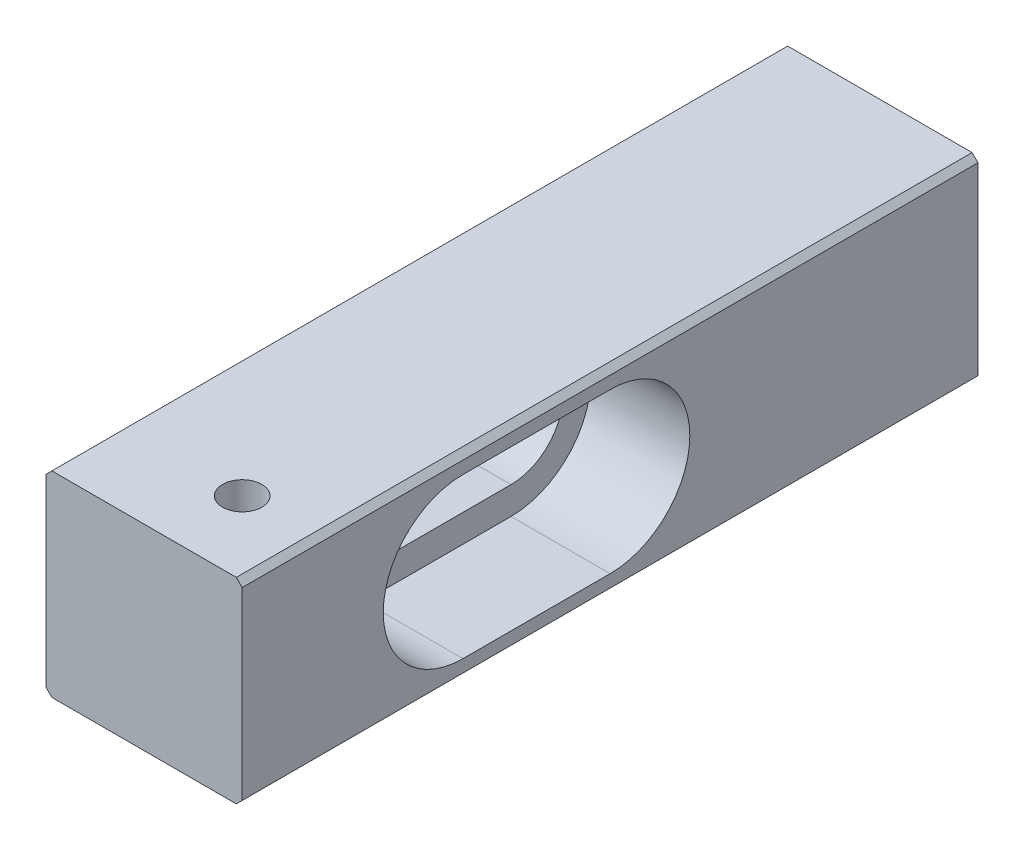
ISO-10303-21;
HEADER;
FILE_DESCRIPTION(('STEP AP214'),'2;1');
FILE_NAME('part.step','',(''),(''),'','','');
FILE_SCHEMA(('AUTOMOTIVE_DESIGN { 1 0 10303 214 1 1 1 1 }'));
ENDSEC;
DATA;
#1=APPLICATION_CONTEXT('core data for automotive mechanical design processes');
#2=APPLICATION_PROTOCOL_DEFINITION('international standard','automotive_design',2000,#1);
#3=PRODUCT_CONTEXT('',#1,'mechanical');
#4=PRODUCT('Part','Part','',(#3));
#5=PRODUCT_RELATED_PRODUCT_CATEGORY('part','',(#4));
#6=PRODUCT_DEFINITION_FORMATION('','',#4);
#7=PRODUCT_DEFINITION_CONTEXT('part definition',#1,'design');
#8=PRODUCT_DEFINITION('design','',#6,#7);
#9=PRODUCT_DEFINITION_SHAPE('','',#8);
#10=(LENGTH_UNIT() NAMED_UNIT(*) SI_UNIT(.MILLI.,.METRE.));
#11=(NAMED_UNIT(*) PLANE_ANGLE_UNIT() SI_UNIT($,.RADIAN.));
#12=(NAMED_UNIT(*) SI_UNIT($,.STERADIAN.) SOLID_ANGLE_UNIT());
#13=UNCERTAINTY_MEASURE_WITH_UNIT(LENGTH_MEASURE(1.E-05),#10,'distance_accuracy_value','');
#14=(GEOMETRIC_REPRESENTATION_CONTEXT(3) GLOBAL_UNCERTAINTY_ASSIGNED_CONTEXT((#13)) GLOBAL_UNIT_ASSIGNED_CONTEXT((#10,
#11,#12)) REPRESENTATION_CONTEXT('',''));
#15=CARTESIAN_POINT('',(0.,0.,0.));
#16=DIRECTION('',(0.,0.,1.));
#17=DIRECTION('',(1.,0.,0.));
#18=AXIS2_PLACEMENT_3D('',#15,#16,#17);
#19=CARTESIAN_POINT('',(-6.35000000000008,-12.7,95.25));
#20=DIRECTION('',(1.,0.,0.));
#21=DIRECTION('',(0.,1.,0.));
#22=AXIS2_PLACEMENT_3D('',#19,#20,#21);
#23=PLANE('',#22);
#24=CARTESIAN_POINT('',(-6.35000000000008,0.,47.625));
#25=DIRECTION('',(1.,0.,0.));
#26=DIRECTION('',(0.,0.,-1.));
#27=AXIS2_PLACEMENT_3D('',#24,#25,#26);
#28=CIRCLE('',#27,6.74687499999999);
#29=CARTESIAN_POINT('',(-6.35000000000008,-6.74687499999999,47.625));
#30=VERTEX_POINT('',#29);
#31=CARTESIAN_POINT('',(-6.35000000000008,6.74687499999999,47.625));
#32=VERTEX_POINT('',#31);
#33=EDGE_CURVE('E748',#30,#32,#28,.T.);
#34=ORIENTED_EDGE('',*,*,#33,.T.);
#35=DIRECTION('',(0.,0.,1.));
#36=VECTOR('',#35,1.);
#37=CARTESIAN_POINT('',(-6.35000000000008,6.74687499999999,47.625));
#38=LINE('',#37,#36);
#39=CARTESIAN_POINT('',(-6.35000000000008,6.746875,66.675));
#40=VERTEX_POINT('',#39);
#41=EDGE_CURVE('E592',#32,#40,#38,.T.);
#42=ORIENTED_EDGE('',*,*,#41,.T.);
#43=CARTESIAN_POINT('',(-6.35000000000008,0.,66.675));
#44=DIRECTION('',(1.,0.,0.));
#45=DIRECTION('',(0.,0.,-1.));
#46=AXIS2_PLACEMENT_3D('',#43,#44,#45);
#47=CIRCLE('',#46,6.74687499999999);
#48=CARTESIAN_POINT('',(-6.35000000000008,-6.74687499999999,66.675));
#49=VERTEX_POINT('',#48);
#50=EDGE_CURVE('E601',#40,#49,#47,.T.);
#51=ORIENTED_EDGE('',*,*,#50,.T.);
#52=DIRECTION('',(0.,0.,1.));
#53=VECTOR('',#52,1.);
#54=CARTESIAN_POINT('',(-6.35000000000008,-6.74687499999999,47.625));
#55=LINE('',#54,#53);
#56=EDGE_CURVE('E755',#30,#49,#55,.T.);
#57=ORIENTED_EDGE('',*,*,#56,.F.);
#58=EDGE_LOOP('',(#34,#42,#51,#57));
#59=FACE_BOUND('',#58,.T.);
#60=DIRECTION('',(0.,-1.,0.));
#61=VECTOR('',#60,1.);
#62=CARTESIAN_POINT('',(-6.35000000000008,-12.7,0.));
#63=LINE('',#62,#61);
#64=CARTESIAN_POINT('',(-6.35000000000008,11.938,0.));
#65=VERTEX_POINT('',#64);
#66=CARTESIAN_POINT('',(-6.35000000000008,-11.938,0.));
#67=VERTEX_POINT('',#66);
#68=EDGE_CURVE('E719',#65,#67,#63,.T.);
#69=ORIENTED_EDGE('',*,*,#68,.T.);
#70=DIRECTION('',(0.,0.,1.));
#71=VECTOR('',#70,1.);
#72=CARTESIAN_POINT('',(-6.35000000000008,-11.938,95.25));
#73=LINE('',#72,#71);
#74=CARTESIAN_POINT('',(-6.35000000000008,-11.938,95.25));
#75=VERTEX_POINT('',#74);
#76=EDGE_CURVE('E673',#67,#75,#73,.T.);
#77=ORIENTED_EDGE('',*,*,#76,.T.);
#78=DIRECTION('',(0.,-1.,0.));
#79=VECTOR('',#78,1.);
#80=CARTESIAN_POINT('',(-6.35000000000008,-12.7,95.25));
#81=LINE('',#80,#79);
#82=CARTESIAN_POINT('',(-6.35000000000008,11.938,95.25));
#83=VERTEX_POINT('',#82);
#84=EDGE_CURVE('E718',#83,#75,#81,.T.);
#85=ORIENTED_EDGE('',*,*,#84,.F.);
#86=DIRECTION('',(0.,0.,-1.));
#87=VECTOR('',#86,1.);
#88=CARTESIAN_POINT('',(-6.35000000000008,11.938,95.25));
#89=LINE('',#88,#87);
#90=EDGE_CURVE('E669',#83,#65,#89,.T.);
#91=ORIENTED_EDGE('',*,*,#90,.T.);
#92=EDGE_LOOP('',(#69,#77,#85,#91));
#93=FACE_BOUND('',#92,.T.);
#94=ADVANCED_FACE('F465',(#59,#93),#23,.F.);
#95=CARTESIAN_POINT('',(-6.35000000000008,-12.7,95.25));
#96=DIRECTION('',(0.,1.,0.));
#97=DIRECTION('',(-1.,0.,0.));
#98=AXIS2_PLACEMENT_3D('',#95,#96,#97);
#99=PLANE('',#98);
#100=CARTESIAN_POINT('',(9.52500000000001,-12.7,85.725));
#101=DIRECTION('',(0.,-1.,0.));
#102=DIRECTION('',(0.,0.,-1.));
#103=AXIS2_PLACEMENT_3D('',#100,#101,#102);
#104=CIRCLE('',#103,2.5527);
#105=CARTESIAN_POINT('',(9.52500000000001,-12.7,83.1723));
#106=VERTEX_POINT('',#105);
#107=EDGE_CURVE('E735',#106,#106,#104,.T.);
#108=ORIENTED_EDGE('',*,*,#107,.F.);
#109=EDGE_LOOP('',(#108));
#110=FACE_BOUND('',#109,.T.);
#111=DIRECTION('',(1.,0.,0.));
#112=VECTOR('',#111,1.);
#113=CARTESIAN_POINT('',(-6.35000000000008,-12.7,95.25));
#114=LINE('',#113,#112);
#115=CARTESIAN_POINT('',(-5.58799999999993,-12.7,95.25));
#116=VERTEX_POINT('',#115);
#117=CARTESIAN_POINT('',(18.2880000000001,-12.7,95.25));
#118=VERTEX_POINT('',#117);
#119=EDGE_CURVE('E729',#116,#118,#114,.T.);
#120=ORIENTED_EDGE('',*,*,#119,.F.);
#121=DIRECTION('',(0.,0.,-1.));
#122=VECTOR('',#121,1.);
#123=CARTESIAN_POINT('',(-5.58799999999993,-12.7,95.25));
#124=LINE('',#123,#122);
#125=CARTESIAN_POINT('',(-5.58799999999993,-12.7,0.));
#126=VERTEX_POINT('',#125);
#127=EDGE_CURVE('E652',#116,#126,#124,.T.);
#128=ORIENTED_EDGE('',*,*,#127,.T.);
#129=DIRECTION('',(1.,0.,0.));
#130=VECTOR('',#129,1.);
#131=CARTESIAN_POINT('',(-6.35000000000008,-12.7,0.));
#132=LINE('',#131,#130);
#133=CARTESIAN_POINT('',(18.2880000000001,-12.7,0.));
#134=VERTEX_POINT('',#133);
#135=EDGE_CURVE('E713',#126,#134,#132,.T.);
#136=ORIENTED_EDGE('',*,*,#135,.T.);
#137=DIRECTION('',(0.,0.,1.));
#138=VECTOR('',#137,1.);
#139=CARTESIAN_POINT('',(18.2880000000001,-12.7,95.25));
#140=LINE('',#139,#138);
#141=EDGE_CURVE('E649',#134,#118,#140,.T.);
#142=ORIENTED_EDGE('',*,*,#141,.T.);
#143=EDGE_LOOP('',(#120,#128,#136,#142));
#144=FACE_BOUND('',#143,.T.);
#145=ADVANCED_FACE('F837',(#110,#144),#99,.F.);
#146=CARTESIAN_POINT('',(19.05,-12.7,95.25));
#147=DIRECTION('',(-1.,0.,0.));
#148=DIRECTION('',(0.,0.,1.));
#149=AXIS2_PLACEMENT_3D('',#146,#147,#148);
#150=PLANE('',#149);
#151=CARTESIAN_POINT('',(19.05,0.,47.625));
#152=DIRECTION('',(1.,0.,0.));
#153=DIRECTION('',(0.,0.,-1.));
#154=AXIS2_PLACEMENT_3D('',#151,#152,#153);
#155=CIRCLE('',#154,10.31875);
#156=CARTESIAN_POINT('',(19.05,-10.31875,47.625));
#157=VERTEX_POINT('',#156);
#158=CARTESIAN_POINT('',(19.05,10.31875,47.625));
#159=VERTEX_POINT('',#158);
#160=EDGE_CURVE('E635',#157,#159,#155,.T.);
#161=ORIENTED_EDGE('',*,*,#160,.F.);
#162=DIRECTION('',(0.,0.,1.));
#163=VECTOR('',#162,1.);
#164=CARTESIAN_POINT('',(19.05,-10.31875,47.625));
#165=LINE('',#164,#163);
#166=CARTESIAN_POINT('',(19.05,-10.31875,66.675));
#167=VERTEX_POINT('',#166);
#168=EDGE_CURVE('E643',#157,#167,#165,.T.);
#169=ORIENTED_EDGE('',*,*,#168,.T.);
#170=CARTESIAN_POINT('',(19.05,0.,66.675));
#171=DIRECTION('',(1.,0.,0.));
#172=DIRECTION('',(0.,0.,-1.));
#173=AXIS2_PLACEMENT_3D('',#170,#171,#172);
#174=CIRCLE('',#173,10.31875);
#175=CARTESIAN_POINT('',(19.05,10.31875,66.675));
#176=VERTEX_POINT('',#175);
#177=EDGE_CURVE('E616',#176,#167,#174,.T.);
#178=ORIENTED_EDGE('',*,*,#177,.F.);
#179=DIRECTION('',(0.,0.,1.));
#180=VECTOR('',#179,1.);
#181=CARTESIAN_POINT('',(19.05,10.31875,47.625));
#182=LINE('',#181,#180);
#183=EDGE_CURVE('E641',#159,#176,#182,.T.);
#184=ORIENTED_EDGE('',*,*,#183,.F.);
#185=EDGE_LOOP('',(#161,#169,#178,#184));
#186=FACE_BOUND('',#185,.T.);
#187=DIRECTION('',(0.,1.,0.));
#188=VECTOR('',#187,1.);
#189=CARTESIAN_POINT('',(19.05,-12.7,0.));
#190=LINE('',#189,#188);
#191=CARTESIAN_POINT('',(19.05,-11.938,0.));
#192=VERTEX_POINT('',#191);
#193=CARTESIAN_POINT('',(19.05,11.938,0.));
#194=VERTEX_POINT('',#193);
#195=EDGE_CURVE('E701',#192,#194,#190,.T.);
#196=ORIENTED_EDGE('',*,*,#195,.T.);
#197=DIRECTION('',(0.,0.,1.));
#198=VECTOR('',#197,1.);
#199=CARTESIAN_POINT('',(19.05,11.938,95.25));
#200=LINE('',#199,#198);
#201=CARTESIAN_POINT('',(19.05,11.938,95.25));
#202=VERTEX_POINT('',#201);
#203=EDGE_CURVE('E14',#194,#202,#200,.T.);
#204=ORIENTED_EDGE('',*,*,#203,.T.);
#205=DIRECTION('',(0.,1.,0.));
#206=VECTOR('',#205,1.);
#207=CARTESIAN_POINT('',(19.05,-12.7,95.25));
#208=LINE('',#207,#206);
#209=CARTESIAN_POINT('',(19.05,-11.938,95.25));
#210=VERTEX_POINT('',#209);
#211=EDGE_CURVE('E703',#210,#202,#208,.T.);
#212=ORIENTED_EDGE('',*,*,#211,.F.);
#213=DIRECTION('',(0.,0.,-1.));
#214=VECTOR('',#213,1.);
#215=CARTESIAN_POINT('',(19.05,-11.938,95.25));
#216=LINE('',#215,#214);
#217=EDGE_CURVE('E475',#210,#192,#216,.T.);
#218=ORIENTED_EDGE('',*,*,#217,.T.);
#219=EDGE_LOOP('',(#196,#204,#212,#218));
#220=FACE_BOUND('',#219,.T.);
#221=ADVANCED_FACE('F700',(#186,#220),#150,.F.);
#222=CARTESIAN_POINT('',(-6.35000000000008,12.7,95.25));
#223=DIRECTION('',(0.,-1.,0.));
#224=DIRECTION('',(0.,0.,-1.));
#225=AXIS2_PLACEMENT_3D('',#222,#223,#224);
#226=PLANE('',#225);
#227=CARTESIAN_POINT('',(9.52500000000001,12.7,85.725));
#228=DIRECTION('',(0.,-1.,0.));
#229=DIRECTION('',(0.,0.,-1.));
#230=AXIS2_PLACEMENT_3D('',#227,#228,#229);
#231=CIRCLE('',#230,2.55269999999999);
#232=CARTESIAN_POINT('',(9.52500000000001,12.7,83.1723));
#233=VERTEX_POINT('',#232);
#234=EDGE_CURVE('E740',#233,#233,#231,.T.);
#235=ORIENTED_EDGE('',*,*,#234,.T.);
#236=EDGE_LOOP('',(#235));
#237=FACE_BOUND('',#236,.T.);
#238=DIRECTION('',(-1.,0.,0.));
#239=VECTOR('',#238,1.);
#240=CARTESIAN_POINT('',(-6.35000000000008,12.7,0.));
#241=LINE('',#240,#239);
#242=CARTESIAN_POINT('',(18.2880000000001,12.7,0.));
#243=VERTEX_POINT('',#242);
#244=CARTESIAN_POINT('',(-5.58799999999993,12.7,0.));
#245=VERTEX_POINT('',#244);
#246=EDGE_CURVE('E712',#243,#245,#241,.T.);
#247=ORIENTED_EDGE('',*,*,#246,.T.);
#248=DIRECTION('',(0.,0.,1.));
#249=VECTOR('',#248,1.);
#250=CARTESIAN_POINT('',(-5.58799999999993,12.7,95.25));
#251=LINE('',#250,#249);
#252=CARTESIAN_POINT('',(-5.58799999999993,12.7,95.25));
#253=VERTEX_POINT('',#252);
#254=EDGE_CURVE('E482',#245,#253,#251,.T.);
#255=ORIENTED_EDGE('',*,*,#254,.T.);
#256=DIRECTION('',(-1.,0.,0.));
#257=VECTOR('',#256,1.);
#258=CARTESIAN_POINT('',(-6.35000000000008,12.7,95.25));
#259=LINE('',#258,#257);
#260=CARTESIAN_POINT('',(18.2880000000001,12.7,95.25));
#261=VERTEX_POINT('',#260);
#262=EDGE_CURVE('E653',#261,#253,#259,.T.);
#263=ORIENTED_EDGE('',*,*,#262,.F.);
#264=DIRECTION('',(0.,0.,-1.));
#265=VECTOR('',#264,1.);
#266=CARTESIAN_POINT('',(18.2880000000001,12.7,95.25));
#267=LINE('',#266,#265);
#268=EDGE_CURVE('E687',#261,#243,#267,.T.);
#269=ORIENTED_EDGE('',*,*,#268,.T.);
#270=EDGE_LOOP('',(#247,#255,#263,#269));
#271=FACE_BOUND('',#270,.T.);
#272=ADVANCED_FACE('F875',(#237,#271),#226,.F.);
#273=CARTESIAN_POINT('',(0.,0.,95.25));
#274=DIRECTION('',(0.,0.,-1.));
#275=DIRECTION('',(-1.,0.,0.));
#276=AXIS2_PLACEMENT_3D('',#273,#274,#275);
#277=PLANE('',#276);
#278=ORIENTED_EDGE('',*,*,#84,.T.);
#279=DIRECTION('',(-0.707106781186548,0.707106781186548,0.));
#280=VECTOR('',#279,1.);
#281=CARTESIAN_POINT('',(-5.58799999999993,-12.7,95.25));
#282=LINE('',#281,#280);
#283=EDGE_CURVE('E684',#75,#116,#282,.F.);
#284=ORIENTED_EDGE('',*,*,#283,.T.);
#285=ORIENTED_EDGE('',*,*,#119,.T.);
#286=DIRECTION('',(-0.707106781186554,-0.707106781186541,0.));
#287=VECTOR('',#286,1.);
#288=CARTESIAN_POINT('',(19.05,-11.938,95.25));
#289=LINE('',#288,#287);
#290=EDGE_CURVE('E676',#118,#210,#289,.F.);
#291=ORIENTED_EDGE('',*,*,#290,.T.);
#292=ORIENTED_EDGE('',*,*,#211,.T.);
#293=DIRECTION('',(0.707106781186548,-0.707106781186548,0.));
#294=VECTOR('',#293,1.);
#295=CARTESIAN_POINT('',(18.2880000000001,12.7,95.25));
#296=LINE('',#295,#294);
#297=EDGE_CURVE('E489',#202,#261,#296,.F.);
#298=ORIENTED_EDGE('',*,*,#297,.T.);
#299=ORIENTED_EDGE('',*,*,#262,.T.);
#300=DIRECTION('',(0.707106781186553,0.707106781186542,0.));
#301=VECTOR('',#300,1.);
#302=CARTESIAN_POINT('',(-6.35000000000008,11.938,95.25));
#303=LINE('',#302,#301);
#304=EDGE_CURVE('E681',#253,#83,#303,.F.);
#305=ORIENTED_EDGE('',*,*,#304,.T.);
#306=EDGE_LOOP('',(#278,#284,#285,#291,#292,#298,#299,#305));
#307=FACE_BOUND('',#306,.T.);
#308=ADVANCED_FACE('F872',(#307),#277,.F.);
#309=CARTESIAN_POINT('',(0.,0.,0.));
#310=DIRECTION('',(0.,0.,-1.));
#311=DIRECTION('',(-1.,0.,0.));
#312=AXIS2_PLACEMENT_3D('',#309,#310,#311);
#313=PLANE('',#312);
#314=ORIENTED_EDGE('',*,*,#135,.F.);
#315=DIRECTION('',(0.707106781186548,-0.707106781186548,0.));
#316=VECTOR('',#315,1.);
#317=CARTESIAN_POINT('',(-9.14400000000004,-9.14400000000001,0.));
#318=LINE('',#317,#316);
#319=EDGE_CURVE('E666',#126,#67,#318,.F.);
#320=ORIENTED_EDGE('',*,*,#319,.T.);
#321=ORIENTED_EDGE('',*,*,#68,.F.);
#322=DIRECTION('',(-0.707106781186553,-0.707106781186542,0.));
#323=VECTOR('',#322,1.);
#324=CARTESIAN_POINT('',(-9.14400000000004,9.14400000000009,0.));
#325=LINE('',#324,#323);
#326=EDGE_CURVE('E663',#65,#245,#325,.F.);
#327=ORIENTED_EDGE('',*,*,#326,.T.);
#328=ORIENTED_EDGE('',*,*,#246,.F.);
#329=DIRECTION('',(-0.707106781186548,0.707106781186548,0.));
#330=VECTOR('',#329,1.);
#331=CARTESIAN_POINT('',(15.4939999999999,15.494,0.));
#332=LINE('',#331,#330);
#333=EDGE_CURVE('E660',#243,#194,#332,.F.);
#334=ORIENTED_EDGE('',*,*,#333,.T.);
#335=ORIENTED_EDGE('',*,*,#195,.F.);
#336=DIRECTION('',(0.707106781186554,0.707106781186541,0.));
#337=VECTOR('',#336,1.);
#338=CARTESIAN_POINT('',(15.4939999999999,-15.4940000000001,0.));
#339=LINE('',#338,#337);
#340=EDGE_CURVE('E657',#192,#134,#339,.F.);
#341=ORIENTED_EDGE('',*,*,#340,.T.);
#342=EDGE_LOOP('',(#314,#320,#321,#327,#328,#334,#335,#341));
#343=FACE_BOUND('',#342,.T.);
#344=ADVANCED_FACE('F708',(#343),#313,.T.);
#345=CARTESIAN_POINT('',(19.05,0.,66.675));
#346=DIRECTION('',(1.,0.,0.));
#347=DIRECTION('',(0.,0.,-1.));
#348=AXIS2_PLACEMENT_3D('',#345,#346,#347);
#349=CYLINDRICAL_SURFACE('',#348,10.31875);
#350=CARTESIAN_POINT('',(6.22300000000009,0.,66.675));
#351=DIRECTION('',(1.,0.,0.));
#352=DIRECTION('',(0.,0.,-1.));
#353=AXIS2_PLACEMENT_3D('',#350,#351,#352);
#354=CIRCLE('',#353,10.31875);
#355=CARTESIAN_POINT('',(6.22300000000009,10.31875,66.675));
#356=VERTEX_POINT('',#355);
#357=CARTESIAN_POINT('',(6.22300000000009,-10.31875,66.675));
#358=VERTEX_POINT('',#357);
#359=EDGE_CURVE('E610',#356,#358,#354,.T.);
#360=ORIENTED_EDGE('',*,*,#359,.F.);
#361=DIRECTION('',(-1.,0.,0.));
#362=VECTOR('',#361,1.);
#363=CARTESIAN_POINT('',(6.22300000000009,10.31875,66.675));
#364=LINE('',#363,#362);
#365=EDGE_CURVE('E603',#176,#356,#364,.T.);
#366=ORIENTED_EDGE('',*,*,#365,.F.);
#367=ORIENTED_EDGE('',*,*,#177,.T.);
#368=DIRECTION('',(1.,0.,0.));
#369=VECTOR('',#368,1.);
#370=CARTESIAN_POINT('',(19.05,-10.31875,66.675));
#371=LINE('',#370,#369);
#372=EDGE_CURVE('E766',#358,#167,#371,.T.);
#373=ORIENTED_EDGE('',*,*,#372,.F.);
#374=EDGE_LOOP('',(#360,#366,#367,#373));
#375=FACE_BOUND('',#374,.T.);
#376=ADVANCED_FACE('F817',(#375),#349,.F.);
#377=CARTESIAN_POINT('',(6.22300000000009,6.746875,66.675));
#378=DIRECTION('',(-1.,0.,0.));
#379=DIRECTION('',(0.,0.,1.));
#380=AXIS2_PLACEMENT_3D('',#377,#378,#379);
#381=PLANE('',#380);
#382=DIRECTION('',(0.,0.,1.));
#383=VECTOR('',#382,1.);
#384=CARTESIAN_POINT('',(6.22300000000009,-10.31875,47.625));
#385=LINE('',#384,#383);
#386=CARTESIAN_POINT('',(6.22300000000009,-10.31875,47.625));
#387=VERTEX_POINT('',#386);
#388=EDGE_CURVE('E648',#387,#358,#385,.T.);
#389=ORIENTED_EDGE('',*,*,#388,.F.);
#390=CARTESIAN_POINT('',(6.22300000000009,0.,47.625));
#391=DIRECTION('',(1.,0.,0.));
#392=DIRECTION('',(0.,0.,-1.));
#393=AXIS2_PLACEMENT_3D('',#390,#391,#392);
#394=CIRCLE('',#393,10.31875);
#395=CARTESIAN_POINT('',(6.22300000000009,10.31875,47.625));
#396=VERTEX_POINT('',#395);
#397=EDGE_CURVE('E640',#387,#396,#394,.T.);
#398=ORIENTED_EDGE('',*,*,#397,.T.);
#399=DIRECTION('',(0.,0.,1.));
#400=VECTOR('',#399,1.);
#401=CARTESIAN_POINT('',(6.22300000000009,10.31875,47.625));
#402=LINE('',#401,#400);
#403=EDGE_CURVE('E593',#396,#356,#402,.T.);
#404=ORIENTED_EDGE('',*,*,#403,.T.);
#405=ORIENTED_EDGE('',*,*,#359,.T.);
#406=EDGE_LOOP('',(#389,#398,#404,#405));
#407=FACE_BOUND('',#406,.T.);
#408=CARTESIAN_POINT('',(6.22300000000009,0.,66.675));
#409=DIRECTION('',(1.,0.,0.));
#410=DIRECTION('',(0.,0.,-1.));
#411=AXIS2_PLACEMENT_3D('',#408,#409,#410);
#412=CIRCLE('',#411,6.746875);
#413=CARTESIAN_POINT('',(6.22300000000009,6.746875,66.675));
#414=VERTEX_POINT('',#413);
#415=CARTESIAN_POINT('',(6.22300000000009,-6.74687499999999,66.675));
#416=VERTEX_POINT('',#415);
#417=EDGE_CURVE('E599',#414,#416,#412,.T.);
#418=ORIENTED_EDGE('',*,*,#417,.F.);
#419=DIRECTION('',(0.,0.,1.));
#420=VECTOR('',#419,1.);
#421=CARTESIAN_POINT('',(6.22300000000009,6.746875,47.625));
#422=LINE('',#421,#420);
#423=CARTESIAN_POINT('',(6.22300000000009,6.746875,47.625));
#424=VERTEX_POINT('',#423);
#425=EDGE_CURVE('E582',#424,#414,#422,.T.);
#426=ORIENTED_EDGE('',*,*,#425,.F.);
#427=CARTESIAN_POINT('',(6.22300000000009,0.,47.625));
#428=DIRECTION('',(1.,0.,0.));
#429=DIRECTION('',(0.,0.,-1.));
#430=AXIS2_PLACEMENT_3D('',#427,#428,#429);
#431=CIRCLE('',#430,6.746875);
#432=CARTESIAN_POINT('',(6.22300000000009,-6.74687499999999,47.625));
#433=VERTEX_POINT('',#432);
#434=EDGE_CURVE('E754',#433,#424,#431,.T.);
#435=ORIENTED_EDGE('',*,*,#434,.F.);
#436=DIRECTION('',(0.,0.,1.));
#437=VECTOR('',#436,1.);
#438=CARTESIAN_POINT('',(6.22300000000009,-6.74687499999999,47.625));
#439=LINE('',#438,#437);
#440=EDGE_CURVE('E607',#433,#416,#439,.T.);
#441=ORIENTED_EDGE('',*,*,#440,.T.);
#442=EDGE_LOOP('',(#418,#426,#435,#441));
#443=FACE_BOUND('',#442,.T.);
#444=ADVANCED_FACE('F605',(#407,#443),#381,.F.);
#445=CARTESIAN_POINT('',(19.05,0.,66.675));
#446=DIRECTION('',(1.,0.,0.));
#447=DIRECTION('',(0.,0.,-1.));
#448=AXIS2_PLACEMENT_3D('',#445,#446,#447);
#449=CYLINDRICAL_SURFACE('',#448,6.746875);
#450=ORIENTED_EDGE('',*,*,#50,.F.);
#451=DIRECTION('',(-1.,0.,0.));
#452=VECTOR('',#451,1.);
#453=CARTESIAN_POINT('',(-6.35000000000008,6.746875,66.675));
#454=LINE('',#453,#452);
#455=EDGE_CURVE('E585',#414,#40,#454,.T.);
#456=ORIENTED_EDGE('',*,*,#455,.F.);
#457=ORIENTED_EDGE('',*,*,#417,.T.);
#458=DIRECTION('',(1.,0.,0.));
#459=VECTOR('',#458,1.);
#460=CARTESIAN_POINT('',(19.05,-6.74687499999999,66.675));
#461=LINE('',#460,#459);
#462=EDGE_CURVE('E623',#49,#416,#461,.T.);
#463=ORIENTED_EDGE('',*,*,#462,.F.);
#464=EDGE_LOOP('',(#450,#456,#457,#463));
#465=FACE_BOUND('',#464,.T.);
#466=ADVANCED_FACE('F597',(#465),#449,.F.);
#467=CARTESIAN_POINT('',(19.05,0.,47.625));
#468=DIRECTION('',(1.,0.,0.));
#469=DIRECTION('',(0.,0.,-1.));
#470=AXIS2_PLACEMENT_3D('',#467,#468,#469);
#471=CYLINDRICAL_SURFACE('',#470,10.31875);
#472=ORIENTED_EDGE('',*,*,#160,.T.);
#473=DIRECTION('',(-1.,0.,0.));
#474=VECTOR('',#473,1.);
#475=CARTESIAN_POINT('',(6.22300000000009,10.31875,47.625));
#476=LINE('',#475,#474);
#477=EDGE_CURVE('E770',#159,#396,#476,.T.);
#478=ORIENTED_EDGE('',*,*,#477,.T.);
#479=ORIENTED_EDGE('',*,*,#397,.F.);
#480=DIRECTION('',(1.,0.,0.));
#481=VECTOR('',#480,1.);
#482=CARTESIAN_POINT('',(19.05,-10.31875,47.625));
#483=LINE('',#482,#481);
#484=EDGE_CURVE('E775',#157,#387,#483,.F.);
#485=ORIENTED_EDGE('',*,*,#484,.F.);
#486=EDGE_LOOP('',(#472,#478,#479,#485));
#487=FACE_BOUND('',#486,.T.);
#488=ADVANCED_FACE('F823',(#487),#471,.F.);
#489=CARTESIAN_POINT('',(19.05,0.,47.625));
#490=DIRECTION('',(1.,0.,0.));
#491=DIRECTION('',(0.,0.,-1.));
#492=AXIS2_PLACEMENT_3D('',#489,#490,#491);
#493=CYLINDRICAL_SURFACE('',#492,6.746875);
#494=ORIENTED_EDGE('',*,*,#434,.T.);
#495=DIRECTION('',(-1.,0.,0.));
#496=VECTOR('',#495,1.);
#497=CARTESIAN_POINT('',(-6.35000000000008,6.74687499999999,47.625));
#498=LINE('',#497,#496);
#499=EDGE_CURVE('E588',#424,#32,#498,.T.);
#500=ORIENTED_EDGE('',*,*,#499,.T.);
#501=ORIENTED_EDGE('',*,*,#33,.F.);
#502=DIRECTION('',(1.,0.,0.));
#503=VECTOR('',#502,1.);
#504=CARTESIAN_POINT('',(19.05,-6.74687499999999,47.625));
#505=LINE('',#504,#503);
#506=EDGE_CURVE('E647',#433,#30,#505,.F.);
#507=ORIENTED_EDGE('',*,*,#506,.F.);
#508=EDGE_LOOP('',(#494,#500,#501,#507));
#509=FACE_BOUND('',#508,.T.);
#510=ADVANCED_FACE('F825',(#509),#493,.F.);
#511=CARTESIAN_POINT('',(19.05,-10.31875,47.625));
#512=DIRECTION('',(0.,-1.,0.));
#513=DIRECTION('',(0.,0.,-1.));
#514=AXIS2_PLACEMENT_3D('',#511,#512,#513);
#515=PLANE('',#514);
#516=ORIENTED_EDGE('',*,*,#372,.T.);
#517=ORIENTED_EDGE('',*,*,#168,.F.);
#518=ORIENTED_EDGE('',*,*,#484,.T.);
#519=ORIENTED_EDGE('',*,*,#388,.T.);
#520=EDGE_LOOP('',(#516,#517,#518,#519));
#521=FACE_BOUND('',#520,.T.);
#522=ADVANCED_FACE('F820',(#521),#515,.F.);
#523=CARTESIAN_POINT('',(19.05,-6.74687499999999,47.625));
#524=DIRECTION('',(0.,-1.,0.));
#525=DIRECTION('',(0.,0.,-1.));
#526=AXIS2_PLACEMENT_3D('',#523,#524,#525);
#527=PLANE('',#526);
#528=ORIENTED_EDGE('',*,*,#462,.T.);
#529=ORIENTED_EDGE('',*,*,#440,.F.);
#530=ORIENTED_EDGE('',*,*,#506,.T.);
#531=ORIENTED_EDGE('',*,*,#56,.T.);
#532=EDGE_LOOP('',(#528,#529,#530,#531));
#533=FACE_BOUND('',#532,.T.);
#534=ADVANCED_FACE('F849',(#533),#527,.F.);
#535=CARTESIAN_POINT('',(-6.35000000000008,6.74687499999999,47.625));
#536=DIRECTION('',(0.,1.,0.));
#537=DIRECTION('',(-1.,0.,0.));
#538=AXIS2_PLACEMENT_3D('',#535,#536,#537);
#539=PLANE('',#538);
#540=ORIENTED_EDGE('',*,*,#455,.T.);
#541=ORIENTED_EDGE('',*,*,#41,.F.);
#542=ORIENTED_EDGE('',*,*,#499,.F.);
#543=ORIENTED_EDGE('',*,*,#425,.T.);
#544=EDGE_LOOP('',(#540,#541,#542,#543));
#545=FACE_BOUND('',#544,.T.);
#546=ADVANCED_FACE('F584',(#545),#539,.F.);
#547=CARTESIAN_POINT('',(6.22300000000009,10.31875,47.625));
#548=DIRECTION('',(0.,1.,0.));
#549=DIRECTION('',(0.,0.,1.));
#550=AXIS2_PLACEMENT_3D('',#547,#548,#549);
#551=PLANE('',#550);
#552=ORIENTED_EDGE('',*,*,#365,.T.);
#553=ORIENTED_EDGE('',*,*,#403,.F.);
#554=ORIENTED_EDGE('',*,*,#477,.F.);
#555=ORIENTED_EDGE('',*,*,#183,.T.);
#556=EDGE_LOOP('',(#552,#553,#554,#555));
#557=FACE_BOUND('',#556,.T.);
#558=ADVANCED_FACE('F812',(#557),#551,.F.);
#559=CARTESIAN_POINT('',(9.52500000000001,-12.7,85.725));
#560=DIRECTION('',(0.,-1.,0.));
#561=DIRECTION('',(0.,0.,-1.));
#562=AXIS2_PLACEMENT_3D('',#559,#560,#561);
#563=CYLINDRICAL_SURFACE('',#562,2.5527);
#564=ORIENTED_EDGE('',*,*,#234,.F.);
#565=EDGE_LOOP('',(#564));
#566=FACE_BOUND('',#565,.T.);
#567=ORIENTED_EDGE('',*,*,#107,.T.);
#568=EDGE_LOOP('',(#567));
#569=FACE_BOUND('',#568,.T.);
#570=ADVANCED_FACE('F855',(#566,#569),#563,.F.);
#571=CARTESIAN_POINT('',(-5.58799999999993,-12.7,95.25));
#572=DIRECTION('',(0.707106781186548,0.707106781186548,0.));
#573=DIRECTION('',(0.,0.,-1.));
#574=AXIS2_PLACEMENT_3D('',#571,#572,#573);
#575=PLANE('',#574);
#576=ORIENTED_EDGE('',*,*,#283,.F.);
#577=ORIENTED_EDGE('',*,*,#76,.F.);
#578=ORIENTED_EDGE('',*,*,#319,.F.);
#579=ORIENTED_EDGE('',*,*,#127,.F.);
#580=EDGE_LOOP('',(#576,#577,#578,#579));
#581=FACE_BOUND('',#580,.T.);
#582=ADVANCED_FACE('F860',(#581),#575,.F.);
#583=CARTESIAN_POINT('',(-6.35000000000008,11.938,95.25));
#584=DIRECTION('',(0.707106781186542,-0.707106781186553,0.));
#585=DIRECTION('',(0.,0.,-1.));
#586=AXIS2_PLACEMENT_3D('',#583,#584,#585);
#587=PLANE('',#586);
#588=ORIENTED_EDGE('',*,*,#304,.F.);
#589=ORIENTED_EDGE('',*,*,#254,.F.);
#590=ORIENTED_EDGE('',*,*,#326,.F.);
#591=ORIENTED_EDGE('',*,*,#90,.F.);
#592=EDGE_LOOP('',(#588,#589,#590,#591));
#593=FACE_BOUND('',#592,.T.);
#594=ADVANCED_FACE('F866',(#593),#587,.F.);
#595=CARTESIAN_POINT('',(18.2880000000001,12.7,95.25));
#596=DIRECTION('',(-0.707106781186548,-0.707106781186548,0.));
#597=DIRECTION('',(0.,0.,-1.));
#598=AXIS2_PLACEMENT_3D('',#595,#596,#597);
#599=PLANE('',#598);
#600=ORIENTED_EDGE('',*,*,#297,.F.);
#601=ORIENTED_EDGE('',*,*,#203,.F.);
#602=ORIENTED_EDGE('',*,*,#333,.F.);
#603=ORIENTED_EDGE('',*,*,#268,.F.);
#604=EDGE_LOOP('',(#600,#601,#602,#603));
#605=FACE_BOUND('',#604,.T.);
#606=ADVANCED_FACE('F978',(#605),#599,.F.);
#607=CARTESIAN_POINT('',(19.05,-11.938,95.25));
#608=DIRECTION('',(-0.707106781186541,0.707106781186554,0.));
#609=DIRECTION('',(0.,0.,-1.));
#610=AXIS2_PLACEMENT_3D('',#607,#608,#609);
#611=PLANE('',#610);
#612=ORIENTED_EDGE('',*,*,#290,.F.);
#613=ORIENTED_EDGE('',*,*,#141,.F.);
#614=ORIENTED_EDGE('',*,*,#340,.F.);
#615=ORIENTED_EDGE('',*,*,#217,.F.);
#616=EDGE_LOOP('',(#612,#613,#614,#615));
#617=FACE_BOUND('',#616,.T.);
#618=ADVANCED_FACE('F468',(#617),#611,.F.);
#619=CLOSED_SHELL('',(#94,#145,#221,#272,#308,#344,#376,#444,#466,#488,#510,#522,#534,#546,#558,
#570,#582,#594,#606,#618));
#620=MANIFOLD_SOLID_BREP('B2',#619);
#621=ADVANCED_BREP_SHAPE_REPRESENTATION('',(#18,#620),#14);
#622=SHAPE_DEFINITION_REPRESENTATION(#9,#621);
ENDSEC;
END-ISO-10303-21;
